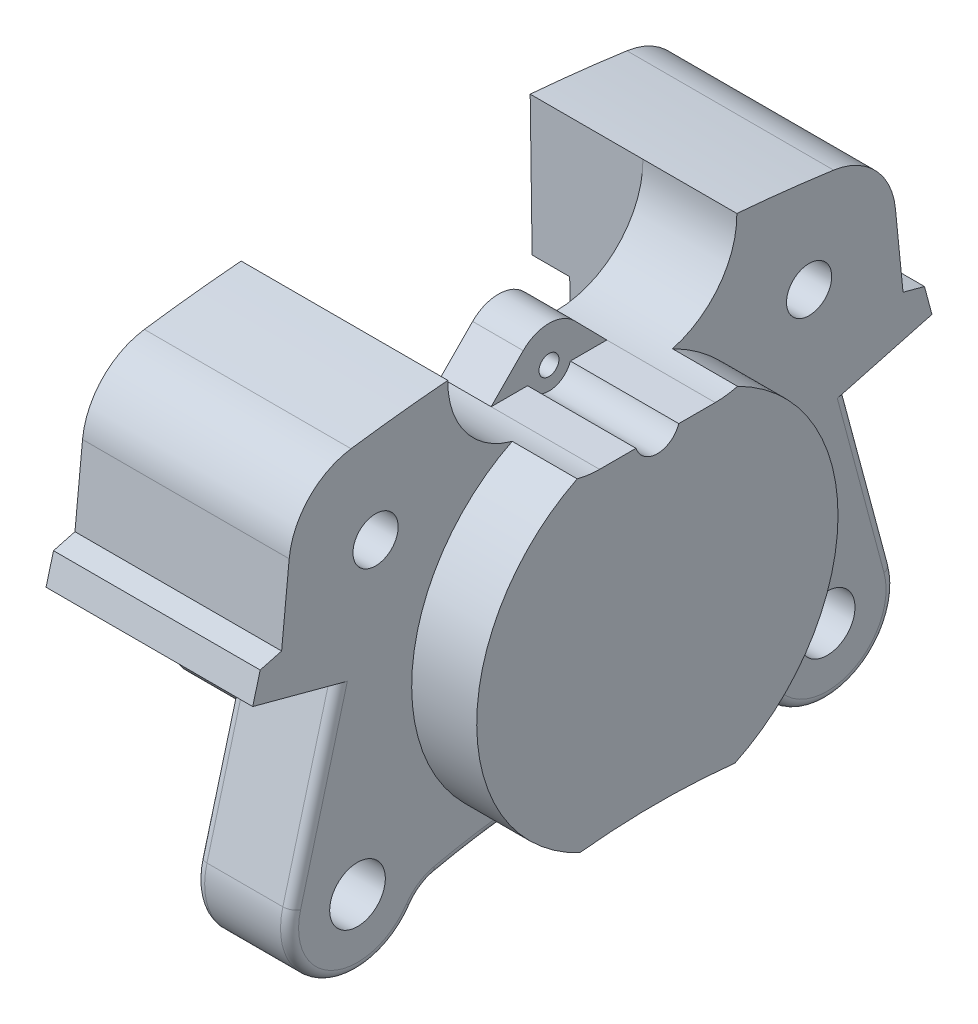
from build123d import *

# Parameters (mm, degrees)
SKETCH1_R           = 31.75
BASE_EXTRUDE_DEPTH  = 11.43
SKETCH2_R           = 4.889499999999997
SKETCH2_R_2         = 3.9687499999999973
BOSS_EXTRUDE1_DEPTH = 16.51
CUT_EXTRUDE1_REACH  = 77.618
SKETCH4_R           = 3.9687499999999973
BOSS_EXTRUDE2_DEPTH = 13.207999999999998
SKETCH5_R           = 3.9687499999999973
BOSS_EXTRUDE3_DEPTH = 6.603999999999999
BOSS_EXTRUDE4_DEPTH = 8.889999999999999
SKETCH7_R           = 3.96875
CUT_EXTRUDE2_DEPTH  = 80.17940157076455
SKETCH8_R           = 1.7525999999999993
CUT_EXTRUDE3_DEPTH  = 80.17940157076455
FILLET1_R           = 6.35
FILLET2_R           = 1.5875


with BuildPart() as part:
    # Sketch1 → Base-Extrude (new body)
    with BuildSketch(Plane(origin=(0, 0, 0), x_dir=(0, 0, -1), z_dir=(1, 0, 0))):
        Circle(SKETCH1_R)
    extrude(amount=-BASE_EXTRUDE_DEPTH)

    # Sketch2 → Boss-Extrude1 (add)
    with BuildSketch(Plane.ZY.offset(11.43)):
        with BuildLine():
            Line((-52.80622251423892, -23.83421823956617), (-44.58871783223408, 6.833926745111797))
            Line((-44.58871783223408, 6.833926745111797), (-59.68999999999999, 10.880303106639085))
            Line((-59.68999999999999, 10.880303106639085), (-58.37519925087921, 15.787206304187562))
            Line((-58.37519925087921, 15.787206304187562), (-54.61, 16.79608840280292))
            Line((-54.61, 16.79608840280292), (-53.27740552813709, 30.16841171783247))
            ThreePointArc((-53.27740552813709, 30.16841171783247), (-49.79918828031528, 37.70673963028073), (-42.40695652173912, 41.485534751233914))
            ThreePointArc((-42.40695652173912, 41.485534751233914), (-33.916845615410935, 42.55706096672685), (-25.4, 43.38982287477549))
            ThreePointArc((-25.4, 43.38982287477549), (-21.01168181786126, 32.47813335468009), (-10.161444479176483, 27.939999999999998))
            Line((-10.161444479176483, 27.939999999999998), (10.161444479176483, 27.939999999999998))
            ThreePointArc((10.161444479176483, 27.939999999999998), (21.011681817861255, 32.47813335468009), (25.4, 43.38982287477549))
            ThreePointArc((25.4, 43.38982287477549), (33.91684561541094, 42.55706096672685), (42.40695652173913, 41.4855347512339))
            ThreePointArc((42.40695652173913, 41.4855347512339), (49.7991882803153, 37.706739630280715), (53.2774055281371, 30.16841171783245))
            Line((53.2774055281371, 30.16841171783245), (54.61, 16.796088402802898))
            Line((54.61, 16.796088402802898), (58.37519925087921, 15.787206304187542))
            Line((58.37519925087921, 15.787206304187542), (59.68999999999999, 10.880303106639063))
            Line((59.68999999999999, 10.880303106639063), (44.58871783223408, 6.833926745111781))
            Line((44.58871783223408, 6.833926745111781), (52.806222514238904, -23.83421823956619))
            ThreePointArc((52.806222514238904, -23.83421823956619), (45.17052275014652, -38.20853572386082), (30.293375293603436, -31.605854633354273))
            ThreePointArc((30.293375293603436, -31.605854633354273), (-2.063e-14, -27.93999999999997), (-30.29337529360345, -31.605854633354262))
            ThreePointArc((-30.29337529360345, -31.605854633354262), (-45.17052275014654, -38.20853572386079), (-52.80622251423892, -23.83421823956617))
        make_face()
        with Locations((41.27499999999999, -26.924000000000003)):
            Circle(SKETCH2_R, mode=Mode.SUBTRACT)
        with Locations((-41.275000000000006, -26.92399999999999)):
            Circle(SKETCH2_R, mode=Mode.SUBTRACT)
        with Locations((-38.099999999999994, 25.463500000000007)):
            Circle(SKETCH2_R_2, mode=Mode.SUBTRACT)
        with Locations((38.099999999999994, 25.463499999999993)):
            Circle(SKETCH2_R_2, mode=Mode.SUBTRACT)
    extrude(amount=BOSS_EXTRUDE1_DEPTH)

    # Sketch3 → Cut-Extrude1 (cut, up to next)
    with BuildSketch(Plane.ZY.offset(11.43), mode=Mode.PRIVATE) as cut_extrude1_sk1:
        with BuildLine():
            Line((-10.161444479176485, 27.93999999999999), (10.161444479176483, 27.939999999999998))
            ThreePointArc((10.161444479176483, 27.939999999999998), (12.140689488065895, 28.06907053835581), (14.086409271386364, 28.454095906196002))
            ThreePointArc((14.086409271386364, 28.454095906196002), (1.94e-15, 31.749999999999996), (-14.086409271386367, 28.454095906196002))
            ThreePointArc((-14.086409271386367, 28.454095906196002), (-12.140689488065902, 28.069070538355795), (-10.161444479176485, 27.93999999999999))
        make_face()
    cut_extrude1_tool1 = extrude(cut_extrude1_sk1.sketch, amount=-CUT_EXTRUDE1_REACH, mode=Mode.PRIVATE) & part.part
    # Sketch3 → Cut-Extrude1 (cut, up to next)
    with BuildSketch(Plane.ZY.offset(11.43), mode=Mode.PRIVATE) as cut_extrude1_sk2:
        with BuildLine():
            ThreePointArc((13.633427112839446, -28.673893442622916), (-2.063e-14, -27.939999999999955), (-13.633427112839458, -28.673893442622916))
            ThreePointArc((-13.633427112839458, -28.673893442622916), (-5.11e-15, -31.749999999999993), (13.633427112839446, -28.673893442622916))
        make_face()
    cut_extrude1_tool2 = extrude(cut_extrude1_sk2.sketch, amount=-CUT_EXTRUDE1_REACH, mode=Mode.PRIVATE) & part.part
    add(cut_extrude1_tool1.solids().sort_by_distance((-11.43, 29.505745, 0))[0], mode=Mode.SUBTRACT)
    add(cut_extrude1_tool2.solids().sort_by_distance((-11.43, -29.617257, 0))[0], mode=Mode.SUBTRACT)

    # Sketch4 → Boss-Extrude2 (add)
    # profile 1 of 2: a face of its own
    with BuildSketch(Plane.ZY.offset(27.94)):
        with BuildLine():
            Line((-25.400000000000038, 43.38982287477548), (-26.123349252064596, -9.143999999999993))
            Line((-26.123349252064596, -9.143999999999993), (-37.37212742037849, -9.143999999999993))
            ThreePointArc((-37.37212742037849, -9.143999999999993), (-41.66212523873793, -7.475711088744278), (-43.69796375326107, -3.3474389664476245))
            Line((-43.69796375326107, -3.3474389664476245), (-44.58871783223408, 6.833926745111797))
            Line((-44.58871783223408, 6.833926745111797), (-59.68999999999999, 10.880303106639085))
            Line((-59.68999999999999, 10.880303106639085), (-58.37519925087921, 15.787206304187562))
            Line((-58.37519925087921, 15.787206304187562), (-54.61, 16.79608840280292))
            Line((-54.61, 16.79608840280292), (-53.27740552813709, 30.16841171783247))
            ThreePointArc((-53.27740552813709, 30.16841171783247), (-49.79918828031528, 37.70673963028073), (-42.40695652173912, 41.485534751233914))
            ThreePointArc((-42.40695652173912, 41.485534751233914), (-33.91684561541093, 42.557060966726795), (-25.400000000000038, 43.38982287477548))
        make_face()
        with Locations((-38.099999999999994, 25.463500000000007)):
            Circle(SKETCH4_R, mode=Mode.SUBTRACT)
    # profile 2 of 2: a face of its own
    with BuildSketch(Plane.ZY.offset(27.94)):
        with BuildLine():
            Line((59.68999999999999, 10.880303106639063), (44.58871783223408, 6.833926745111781))
            Line((44.58871783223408, 6.833926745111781), (43.69796375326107, -3.3474389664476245))
            ThreePointArc((43.69796375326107, -3.3474389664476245), (41.66212523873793, -7.475711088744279), (37.37212742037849, -9.143999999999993))
            Line((37.37212742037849, -9.143999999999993), (26.123349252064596, -9.143999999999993))
            Line((26.123349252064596, -9.143999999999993), (25.4, 43.38982287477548))
            ThreePointArc((25.4, 43.38982287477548), (33.916845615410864, 42.557060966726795), (42.40695652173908, 41.485534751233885))
            ThreePointArc((42.40695652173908, 41.485534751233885), (49.79918828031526, 37.706739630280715), (53.27740552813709, 30.16841171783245))
            Line((53.27740552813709, 30.16841171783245), (54.61, 16.796088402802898))
            Line((54.61, 16.796088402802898), (58.37519925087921, 15.787206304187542))
            Line((58.37519925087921, 15.787206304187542), (59.68999999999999, 10.880303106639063))
        make_face()
        with Locations(Location((38.099999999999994, 25.463500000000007, 0), (0, 0, 180))):
            Circle(SKETCH4_R, mode=Mode.SUBTRACT)
    extrude(amount=BOSS_EXTRUDE2_DEPTH)

    # Sketch5 → Boss-Extrude3 (add)
    # profile 1 of 2: a face of its own
    with BuildSketch(Plane.ZY.offset(41.147999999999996)):
        with BuildLine():
            Line((-25.399999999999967, 43.38982287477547), (-25.73947780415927, 18.73497352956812))
            ThreePointArc((-25.73947780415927, 18.73497352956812), (-40.77842766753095, 15.042577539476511), (-55.31631292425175, 9.708377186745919))
            Line((-55.31631292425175, 9.708377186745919), (-59.68999999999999, 10.88030310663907))
            Line((-59.68999999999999, 10.88030310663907), (-58.37519925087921, 15.787206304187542))
            Line((-58.37519925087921, 15.787206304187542), (-54.61, 16.796088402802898))
            Line((-54.61, 16.796088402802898), (-53.27740552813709, 30.16841171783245))
            ThreePointArc((-53.27740552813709, 30.16841171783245), (-49.79918828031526, 37.70673963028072), (-42.40695652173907, 41.48553475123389))
            ThreePointArc((-42.40695652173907, 41.48553475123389), (-33.916845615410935, 42.55706096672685), (-25.399999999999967, 43.38982287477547))
        make_face()
        with Locations(Location((-38.099999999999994, 25.4635, 0), (0, 0, 180))):
            Circle(SKETCH5_R, mode=Mode.SUBTRACT)
    # profile 2 of 2: a face of its own
    with BuildSketch(Plane.ZY.offset(41.147999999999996)):
        with BuildLine():
            Line((55.31631292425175, 9.708377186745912), (59.68999999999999, 10.880303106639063))
            Line((59.68999999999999, 10.880303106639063), (58.37519925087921, 15.787206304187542))
            Line((58.37519925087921, 15.787206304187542), (54.61, 16.796088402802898))
            Line((54.61, 16.796088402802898), (53.27740552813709, 30.16841171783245))
            ThreePointArc((53.27740552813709, 30.16841171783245), (49.79918828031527, 37.70673963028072), (42.40695652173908, 41.48553475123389))
            ThreePointArc((42.40695652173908, 41.48553475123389), (33.91684561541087, 42.55706096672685), (25.399999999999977, 43.38982287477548))
            Line((25.399999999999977, 43.38982287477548), (25.73947780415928, 18.734973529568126))
            ThreePointArc((25.73947780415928, 18.734973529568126), (40.77842766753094, 15.04257753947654), (55.31631292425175, 9.708377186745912))
        make_face()
        with Locations((38.099999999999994, 25.463500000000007)):
            Circle(SKETCH5_R, mode=Mode.SUBTRACT)
    extrude(amount=BOSS_EXTRUDE3_DEPTH)

    # Sketch6 → Boss-Extrude4 (add)
    with BuildSketch(Plane.ZY.offset(27.94)):
        with BuildLine():
            Line((4.524981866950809, 33.66500158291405), (10.161444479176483, 27.939999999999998))
            Line((10.161444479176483, 27.939999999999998), (-10.161444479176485, 27.939999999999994))
            Line((-10.161444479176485, 27.939999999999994), (-4.524981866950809, 33.66500158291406))
            ThreePointArc((-4.524981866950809, 33.66500158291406), (3.21e-15, 35.56000000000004), (4.524981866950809, 33.66500158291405))
        make_face()
    extrude(amount=-BOSS_EXTRUDE4_DEPTH)

    # Sketch7 → Cut-Extrude2 (cut, through all)
    with BuildSketch(Plane(origin=(-19.05, 0, 0), x_dir=(0, 0, -1), z_dir=(1, 0, 0))):
        with Locations((0, 29.21000000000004)):
            Circle(SKETCH7_R)
    extrude(amount=CUT_EXTRUDE2_DEPTH, mode=Mode.SUBTRACT)

    # Sketch8 → Cut-Extrude3 (cut, through all)
    with BuildSketch(Plane(origin=(-19.05, 0, 0), x_dir=(0, 0, -1), z_dir=(1, 0, 0))):
        with Locations((0, 29.21000000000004)):
            Circle(SKETCH8_R)
    extrude(amount=-CUT_EXTRUDE3_DEPTH, mode=Mode.SUBTRACT)

    # Fillet1
    fillet1_edges = [part.edges().sort_by_distance(p)[0] for p in [
        (-19.685000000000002, -31.60585463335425, -30.293375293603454),
        (-19.685000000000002, -31.605854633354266, 30.293375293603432),
    ]]
    fillet(fillet1_edges, radius=FILLET1_R)

    # Fillet2
    fillet2_edges = [part.edges().sort_by_distance(p)[0] for p in [
        (-27.94, -8.500145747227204, 48.697470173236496),
        (-27.94, -37.78723400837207, -46.225352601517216),
        (-11.43, -29.6205171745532, 20.59192133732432),
        (-11.43, -8.500145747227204, 48.697470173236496),
        (-11.43, -37.787234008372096, 46.2253526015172),
        (-27.94, -37.787234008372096, 46.2253526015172),
        (-11.43, -29.620517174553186, -20.591921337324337),
        (-27.94, -27.939999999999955, -1.155e-14),
        (-11.43, -31.90104073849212, 29.687006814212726),
        (-27.94, -31.90104073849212, 29.687006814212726),
        (-11.43, -31.901040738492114, -29.687006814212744),
        (-27.94, -31.90104073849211, -29.687006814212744),
        (-27.94, -8.500145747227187, -48.697470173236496),
        (-11.43, -37.78723400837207, -46.225352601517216),
        (-11.43, -8.500145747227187, -48.697470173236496),
    ]]
    fillet(fillet2_edges, radius=FILLET2_R)


solid = part.part
